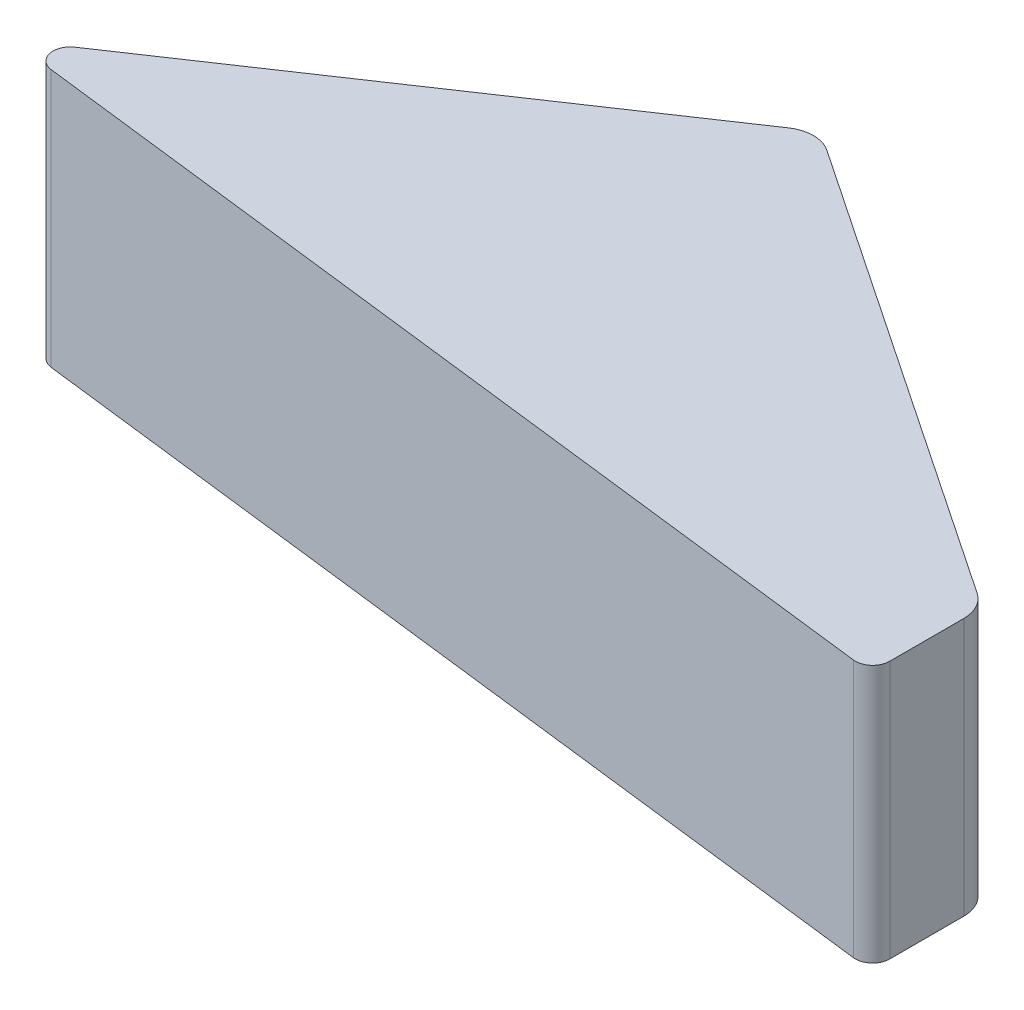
ISO-10303-21;
HEADER;
FILE_DESCRIPTION(('STEP AP214'),'2;1');
FILE_NAME('part.step','',(''),(''),'','','');
FILE_SCHEMA(('AUTOMOTIVE_DESIGN { 1 0 10303 214 1 1 1 1 }'));
ENDSEC;
DATA;
#1=APPLICATION_CONTEXT('core data for automotive mechanical design processes');
#2=APPLICATION_PROTOCOL_DEFINITION('international standard','automotive_design',2000,#1);
#3=PRODUCT_CONTEXT('',#1,'mechanical');
#4=PRODUCT('Part','Part','',(#3));
#5=PRODUCT_RELATED_PRODUCT_CATEGORY('part','',(#4));
#6=PRODUCT_DEFINITION_FORMATION('','',#4);
#7=PRODUCT_DEFINITION_CONTEXT('part definition',#1,'design');
#8=PRODUCT_DEFINITION('design','',#6,#7);
#9=PRODUCT_DEFINITION_SHAPE('','',#8);
#10=(LENGTH_UNIT() NAMED_UNIT(*) SI_UNIT(.MILLI.,.METRE.));
#11=(NAMED_UNIT(*) PLANE_ANGLE_UNIT() SI_UNIT($,.RADIAN.));
#12=(NAMED_UNIT(*) SI_UNIT($,.STERADIAN.) SOLID_ANGLE_UNIT());
#13=UNCERTAINTY_MEASURE_WITH_UNIT(LENGTH_MEASURE(1.E-05),#10,'distance_accuracy_value','');
#14=(GEOMETRIC_REPRESENTATION_CONTEXT(3) GLOBAL_UNCERTAINTY_ASSIGNED_CONTEXT((#13)) GLOBAL_UNIT_ASSIGNED_CONTEXT((#10,
#11,#12)) REPRESENTATION_CONTEXT('',''));
#15=CARTESIAN_POINT('',(0.,0.,0.));
#16=DIRECTION('',(0.,0.,1.));
#17=DIRECTION('',(1.,0.,0.));
#18=AXIS2_PLACEMENT_3D('',#15,#16,#17);
#19=CARTESIAN_POINT('',(56.7,15.,5.53366978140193));
#20=DIRECTION('',(0.,-1.,0.));
#21=DIRECTION('',(0.,0.,-1.));
#22=AXIS2_PLACEMENT_3D('',#19,#20,#21);
#23=CYLINDRICAL_SURFACE('',#22,1.);
#24=CARTESIAN_POINT('',(56.7,0.,5.53366978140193));
#25=DIRECTION('',(0.,1.,0.));
#26=DIRECTION('',(0.,0.,1.));
#27=AXIS2_PLACEMENT_3D('',#24,#25,#26);
#28=CIRCLE('',#27,1.);
#29=CARTESIAN_POINT('',(56.5801798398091,0.,6.52646539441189));
#30=VERTEX_POINT('',#29);
#31=CARTESIAN_POINT('',(57.7,0.,5.53366978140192));
#32=VERTEX_POINT('',#31);
#33=EDGE_CURVE('E129',#30,#32,#28,.T.);
#34=ORIENTED_EDGE('',*,*,#33,.T.);
#35=DIRECTION('',(0.,-1.,0.));
#36=VECTOR('',#35,1.);
#37=CARTESIAN_POINT('',(57.7,15.,5.53366978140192));
#38=LINE('',#37,#36);
#39=CARTESIAN_POINT('',(57.7,15.,5.53366978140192));
#40=VERTEX_POINT('',#39);
#41=EDGE_CURVE('E11',#40,#32,#38,.T.);
#42=ORIENTED_EDGE('',*,*,#41,.F.);
#43=CARTESIAN_POINT('',(56.7,15.,5.53366978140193));
#44=DIRECTION('',(0.,1.,0.));
#45=DIRECTION('',(0.,0.,1.));
#46=AXIS2_PLACEMENT_3D('',#43,#44,#45);
#47=CIRCLE('',#46,1.);
#48=CARTESIAN_POINT('',(56.5801798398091,15.,6.52646539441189));
#49=VERTEX_POINT('',#48);
#50=EDGE_CURVE('E143',#49,#40,#47,.T.);
#51=ORIENTED_EDGE('',*,*,#50,.F.);
#52=DIRECTION('',(0.,-1.,0.));
#53=VECTOR('',#52,1.);
#54=CARTESIAN_POINT('',(56.5801798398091,15.,6.52646539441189));
#55=LINE('',#54,#53);
#56=EDGE_CURVE('E125',#49,#30,#55,.T.);
#57=ORIENTED_EDGE('',*,*,#56,.T.);
#58=EDGE_LOOP('',(#34,#42,#51,#57));
#59=FACE_BOUND('',#58,.T.);
#60=ADVANCED_FACE('F33',(#59),#23,.T.);
#61=CARTESIAN_POINT('',(57.7,15.,5.53366978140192));
#62=DIRECTION('',(-1.,0.,0.));
#63=DIRECTION('',(0.,0.,1.));
#64=AXIS2_PLACEMENT_3D('',#61,#62,#63);
#65=PLANE('',#64);
#66=DIRECTION('',(0.,0.,-1.));
#67=VECTOR('',#66,1.);
#68=CARTESIAN_POINT('',(57.7,0.,5.53366978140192));
#69=LINE('',#68,#67);
#70=CARTESIAN_POINT('',(57.7,0.,1.22505831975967));
#71=VERTEX_POINT('',#70);
#72=EDGE_CURVE('E132',#32,#71,#69,.T.);
#73=ORIENTED_EDGE('',*,*,#72,.T.);
#74=DIRECTION('',(0.,-1.,0.));
#75=VECTOR('',#74,1.);
#76=CARTESIAN_POINT('',(57.7,15.,1.22505831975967));
#77=LINE('',#76,#75);
#78=CARTESIAN_POINT('',(57.7,15.,1.22505831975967));
#79=VERTEX_POINT('',#78);
#80=EDGE_CURVE('E41',#79,#71,#77,.T.);
#81=ORIENTED_EDGE('',*,*,#80,.F.);
#82=DIRECTION('',(0.,0.,-1.));
#83=VECTOR('',#82,1.);
#84=CARTESIAN_POINT('',(57.7,15.,5.53366978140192));
#85=LINE('',#84,#83);
#86=EDGE_CURVE('E92',#40,#79,#85,.T.);
#87=ORIENTED_EDGE('',*,*,#86,.F.);
#88=ORIENTED_EDGE('',*,*,#41,.T.);
#89=EDGE_LOOP('',(#73,#81,#87,#88));
#90=FACE_BOUND('',#89,.T.);
#91=ADVANCED_FACE('F178',(#90),#65,.F.);
#92=CARTESIAN_POINT('',(55.7,15.,1.22505831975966));
#93=DIRECTION('',(0.,-1.,0.));
#94=DIRECTION('',(0.,0.,-1.));
#95=AXIS2_PLACEMENT_3D('',#92,#93,#94);
#96=CYLINDRICAL_SURFACE('',#95,2.);
#97=CARTESIAN_POINT('',(55.7,0.,1.22505831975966));
#98=DIRECTION('',(0.,1.,0.));
#99=DIRECTION('',(0.,0.,1.));
#100=AXIS2_PLACEMENT_3D('',#97,#98,#99);
#101=CIRCLE('',#100,2.);
#102=CARTESIAN_POINT('',(56.8159951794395,0.,-0.434626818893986));
#103=VERTEX_POINT('',#102);
#104=EDGE_CURVE('E134',#71,#103,#101,.T.);
#105=ORIENTED_EDGE('',*,*,#104,.T.);
#106=DIRECTION('',(0.,-1.,0.));
#107=VECTOR('',#106,1.);
#108=CARTESIAN_POINT('',(56.8159951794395,15.,-0.434626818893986));
#109=LINE('',#108,#107);
#110=CARTESIAN_POINT('',(56.8159951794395,15.,-0.434626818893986));
#111=VERTEX_POINT('',#110);
#112=EDGE_CURVE('E150',#111,#103,#109,.T.);
#113=ORIENTED_EDGE('',*,*,#112,.F.);
#114=CARTESIAN_POINT('',(55.7,15.,1.22505831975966));
#115=DIRECTION('',(0.,1.,0.));
#116=DIRECTION('',(0.,0.,1.));
#117=AXIS2_PLACEMENT_3D('',#114,#115,#116);
#118=CIRCLE('',#117,2.);
#119=EDGE_CURVE('E158',#79,#111,#118,.T.);
#120=ORIENTED_EDGE('',*,*,#119,.F.);
#121=ORIENTED_EDGE('',*,*,#80,.T.);
#122=EDGE_LOOP('',(#105,#113,#120,#121));
#123=FACE_BOUND('',#122,.T.);
#124=ADVANCED_FACE('F156',(#123),#96,.T.);
#125=CARTESIAN_POINT('',(30.1159951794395,15.,-18.388075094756));
#126=DIRECTION('',(-0.557997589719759,0.,0.829842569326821));
#127=DIRECTION('',(0.829842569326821,0.,0.557997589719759));
#128=AXIS2_PLACEMENT_3D('',#125,#126,#127);
#129=PLANE('',#128);
#130=DIRECTION('',(-0.829842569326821,0.,-0.557997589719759));
#131=VECTOR('',#130,1.);
#132=CARTESIAN_POINT('',(30.1159951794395,0.,-18.388075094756));
#133=LINE('',#132,#131);
#134=CARTESIAN_POINT('',(30.1159951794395,0.,-18.388075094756));
#135=VERTEX_POINT('',#134);
#136=EDGE_CURVE('E136',#103,#135,#133,.T.);
#137=ORIENTED_EDGE('',*,*,#136,.T.);
#138=DIRECTION('',(0.,-1.,0.));
#139=VECTOR('',#138,1.);
#140=CARTESIAN_POINT('',(30.1159951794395,15.,-18.388075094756));
#141=LINE('',#140,#139);
#142=CARTESIAN_POINT('',(30.1159951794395,15.,-18.388075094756));
#143=VERTEX_POINT('',#142);
#144=EDGE_CURVE('E147',#143,#135,#141,.T.);
#145=ORIENTED_EDGE('',*,*,#144,.F.);
#146=DIRECTION('',(-0.829842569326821,0.,-0.557997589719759));
#147=VECTOR('',#146,1.);
#148=CARTESIAN_POINT('',(30.1159951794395,15.,-18.388075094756));
#149=LINE('',#148,#147);
#150=EDGE_CURVE('E170',#111,#143,#149,.T.);
#151=ORIENTED_EDGE('',*,*,#150,.F.);
#152=ORIENTED_EDGE('',*,*,#112,.T.);
#153=EDGE_LOOP('',(#137,#145,#151,#152));
#154=FACE_BOUND('',#153,.T.);
#155=ADVANCED_FACE('F166',(#154),#129,.F.);
#156=CARTESIAN_POINT('',(29.,15.,-16.7283899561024));
#157=DIRECTION('',(0.,-1.,0.));
#158=DIRECTION('',(0.,0.,-1.));
#159=AXIS2_PLACEMENT_3D('',#156,#157,#158);
#160=CYLINDRICAL_SURFACE('',#159,2.);
#161=CARTESIAN_POINT('',(29.,0.,-16.7283899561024));
#162=DIRECTION('',(0.,1.,0.));
#163=DIRECTION('',(0.,0.,-1.));
#164=AXIS2_PLACEMENT_3D('',#161,#162,#163);
#165=CIRCLE('',#164,2.);
#166=CARTESIAN_POINT('',(27.8840048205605,0.,-18.388075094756));
#167=VERTEX_POINT('',#166);
#168=EDGE_CURVE('E138',#135,#167,#165,.T.);
#169=ORIENTED_EDGE('',*,*,#168,.T.);
#170=DIRECTION('',(0.,-1.,0.));
#171=VECTOR('',#170,1.);
#172=CARTESIAN_POINT('',(27.8840048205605,15.,-18.388075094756));
#173=LINE('',#172,#171);
#174=CARTESIAN_POINT('',(27.8840048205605,15.,-18.388075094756));
#175=VERTEX_POINT('',#174);
#176=EDGE_CURVE('E120',#175,#167,#173,.T.);
#177=ORIENTED_EDGE('',*,*,#176,.F.);
#178=CARTESIAN_POINT('',(29.,15.,-16.7283899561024));
#179=DIRECTION('',(0.,1.,0.));
#180=DIRECTION('',(0.,0.,-1.));
#181=AXIS2_PLACEMENT_3D('',#178,#179,#180);
#182=CIRCLE('',#181,2.);
#183=EDGE_CURVE('E111',#143,#175,#182,.T.);
#184=ORIENTED_EDGE('',*,*,#183,.F.);
#185=ORIENTED_EDGE('',*,*,#144,.T.);
#186=EDGE_LOOP('',(#169,#177,#184,#185));
#187=FACE_BOUND('',#186,.T.);
#188=ADVANCED_FACE('F169',(#187),#160,.T.);
#189=CARTESIAN_POINT('',(27.8840048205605,15.,-18.388075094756));
#190=DIRECTION('',(0.557997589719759,0.,0.829842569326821));
#191=DIRECTION('',(0.829842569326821,0.,-0.557997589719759));
#192=AXIS2_PLACEMENT_3D('',#189,#190,#191);
#193=PLANE('',#192);
#194=DIRECTION('',(-0.829842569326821,0.,0.557997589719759));
#195=VECTOR('',#194,1.);
#196=CARTESIAN_POINT('',(27.8840048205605,0.,-18.388075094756));
#197=LINE('',#196,#195);
#198=CARTESIAN_POINT('',(3.06825806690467,0.,-1.70162469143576));
#199=VERTEX_POINT('',#198);
#200=EDGE_CURVE('E119',#167,#199,#197,.T.);
#201=ORIENTED_EDGE('',*,*,#200,.T.);
#202=DIRECTION('',(0.,-1.,0.));
#203=VECTOR('',#202,1.);
#204=CARTESIAN_POINT('',(3.06825806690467,15.,-1.70162469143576));
#205=LINE('',#204,#203);
#206=CARTESIAN_POINT('',(3.06825806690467,15.,-1.70162469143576));
#207=VERTEX_POINT('',#206);
#208=EDGE_CURVE('E116',#207,#199,#205,.T.);
#209=ORIENTED_EDGE('',*,*,#208,.F.);
#210=DIRECTION('',(-0.829842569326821,0.,0.557997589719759));
#211=VECTOR('',#210,1.);
#212=CARTESIAN_POINT('',(27.8840048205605,15.,-18.388075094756));
#213=LINE('',#212,#211);
#214=EDGE_CURVE('E105',#175,#207,#213,.T.);
#215=ORIENTED_EDGE('',*,*,#214,.F.);
#216=ORIENTED_EDGE('',*,*,#176,.T.);
#217=EDGE_LOOP('',(#201,#209,#215,#216));
#218=FACE_BOUND('',#217,.T.);
#219=ADVANCED_FACE('F117',(#218),#193,.F.);
#220=CARTESIAN_POINT('',(3.6262556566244,15.,-0.871782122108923));
#221=DIRECTION('',(0.,-1.,0.));
#222=DIRECTION('',(0.,0.,-1.));
#223=AXIS2_PLACEMENT_3D('',#220,#221,#222);
#224=CYLINDRICAL_SURFACE('',#223,1.);
#225=CARTESIAN_POINT('',(3.6262556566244,0.,-0.871782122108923));
#226=DIRECTION('',(0.,1.,0.));
#227=DIRECTION('',(0.,0.,1.));
#228=AXIS2_PLACEMENT_3D('',#225,#226,#227);
#229=CIRCLE('',#228,1.);
#230=CARTESIAN_POINT('',(3.50643549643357,0.,0.121013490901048));
#231=VERTEX_POINT('',#230);
#232=EDGE_CURVE('E78',#199,#231,#229,.T.);
#233=ORIENTED_EDGE('',*,*,#232,.T.);
#234=DIRECTION('',(0.,-1.,0.));
#235=VECTOR('',#234,1.);
#236=CARTESIAN_POINT('',(3.50643549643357,15.,0.121013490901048));
#237=LINE('',#236,#235);
#238=CARTESIAN_POINT('',(3.50643549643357,15.,0.121013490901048));
#239=VERTEX_POINT('',#238);
#240=EDGE_CURVE('E121',#239,#231,#237,.T.);
#241=ORIENTED_EDGE('',*,*,#240,.F.);
#242=CARTESIAN_POINT('',(3.6262556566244,15.,-0.871782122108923));
#243=DIRECTION('',(0.,1.,0.));
#244=DIRECTION('',(0.,0.,1.));
#245=AXIS2_PLACEMENT_3D('',#242,#243,#244);
#246=CIRCLE('',#245,1.);
#247=EDGE_CURVE('E109',#207,#239,#246,.T.);
#248=ORIENTED_EDGE('',*,*,#247,.F.);
#249=ORIENTED_EDGE('',*,*,#208,.T.);
#250=EDGE_LOOP('',(#233,#241,#248,#249));
#251=FACE_BOUND('',#250,.T.);
#252=ADVANCED_FACE('F123',(#251),#224,.T.);
#253=CARTESIAN_POINT('',(3.50643549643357,15.,0.121013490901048));
#254=DIRECTION('',(0.119820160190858,0.,-0.992795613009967));
#255=DIRECTION('',(-0.992795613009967,0.,-0.119820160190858));
#256=AXIS2_PLACEMENT_3D('',#253,#254,#255);
#257=PLANE('',#256);
#258=DIRECTION('',(0.992795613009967,0.,0.119820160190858));
#259=VECTOR('',#258,1.);
#260=CARTESIAN_POINT('',(3.50643549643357,0.,0.121013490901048));
#261=LINE('',#260,#259);
#262=EDGE_CURVE('E84',#231,#30,#261,.T.);
#263=ORIENTED_EDGE('',*,*,#262,.T.);
#264=ORIENTED_EDGE('',*,*,#56,.F.);
#265=DIRECTION('',(0.992795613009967,0.,0.119820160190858));
#266=VECTOR('',#265,1.);
#267=CARTESIAN_POINT('',(3.50643549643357,15.,0.121013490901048));
#268=LINE('',#267,#266);
#269=EDGE_CURVE('E49',#239,#49,#268,.T.);
#270=ORIENTED_EDGE('',*,*,#269,.F.);
#271=ORIENTED_EDGE('',*,*,#240,.T.);
#272=EDGE_LOOP('',(#263,#264,#270,#271));
#273=FACE_BOUND('',#272,.T.);
#274=ADVANCED_FACE('F194',(#273),#257,.F.);
#275=CARTESIAN_POINT('',(56.7,15.,5.53366978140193));
#276=DIRECTION('',(0.,1.,0.));
#277=DIRECTION('',(0.,0.,1.));
#278=AXIS2_PLACEMENT_3D('',#275,#276,#277);
#279=PLANE('',#278);
#280=ORIENTED_EDGE('',*,*,#50,.T.);
#281=ORIENTED_EDGE('',*,*,#86,.T.);
#282=ORIENTED_EDGE('',*,*,#119,.T.);
#283=ORIENTED_EDGE('',*,*,#150,.T.);
#284=ORIENTED_EDGE('',*,*,#183,.T.);
#285=ORIENTED_EDGE('',*,*,#214,.T.);
#286=ORIENTED_EDGE('',*,*,#247,.T.);
#287=ORIENTED_EDGE('',*,*,#269,.T.);
#288=EDGE_LOOP('',(#280,#281,#282,#283,#284,#285,#286,#287));
#289=FACE_BOUND('',#288,.T.);
#290=ADVANCED_FACE('F107',(#289),#279,.T.);
#291=CARTESIAN_POINT('',(56.7,0.,5.53366978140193));
#292=DIRECTION('',(0.,1.,0.));
#293=DIRECTION('',(0.,0.,1.));
#294=AXIS2_PLACEMENT_3D('',#291,#292,#293);
#295=PLANE('',#294);
#296=ORIENTED_EDGE('',*,*,#33,.F.);
#297=ORIENTED_EDGE('',*,*,#262,.F.);
#298=ORIENTED_EDGE('',*,*,#232,.F.);
#299=ORIENTED_EDGE('',*,*,#200,.F.);
#300=ORIENTED_EDGE('',*,*,#168,.F.);
#301=ORIENTED_EDGE('',*,*,#136,.F.);
#302=ORIENTED_EDGE('',*,*,#104,.F.);
#303=ORIENTED_EDGE('',*,*,#72,.F.);
#304=EDGE_LOOP('',(#296,#297,#298,#299,#300,#301,#302,#303));
#305=FACE_BOUND('',#304,.T.);
#306=ADVANCED_FACE('F162',(#305),#295,.F.);
#307=CLOSED_SHELL('',(#60,#91,#124,#155,#188,#219,#252,#274,#290,#306));
#308=MANIFOLD_SOLID_BREP('B2',#307);
#309=ADVANCED_BREP_SHAPE_REPRESENTATION('',(#18,#308),#14);
#310=SHAPE_DEFINITION_REPRESENTATION(#9,#309);
ENDSEC;
END-ISO-10303-21;
